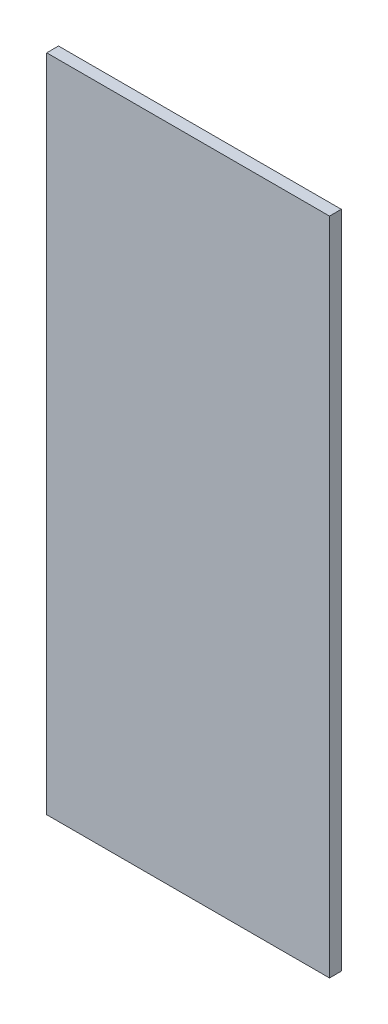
from build123d import *

# Parameters (mm, degrees)
SKETCH1_W      = 457.2
SKETCH1_H      = 1066.8
EXTRUDE1_DEPTH = 19.05


with BuildPart() as part:
    # Sketch1 → Extrude1 (new body)
    with BuildSketch(Plane.XY):
        with Locations((228.6, 533.4)):
            Rectangle(SKETCH1_W, SKETCH1_H)
    extrude(amount=EXTRUDE1_DEPTH)


solid = part.part
